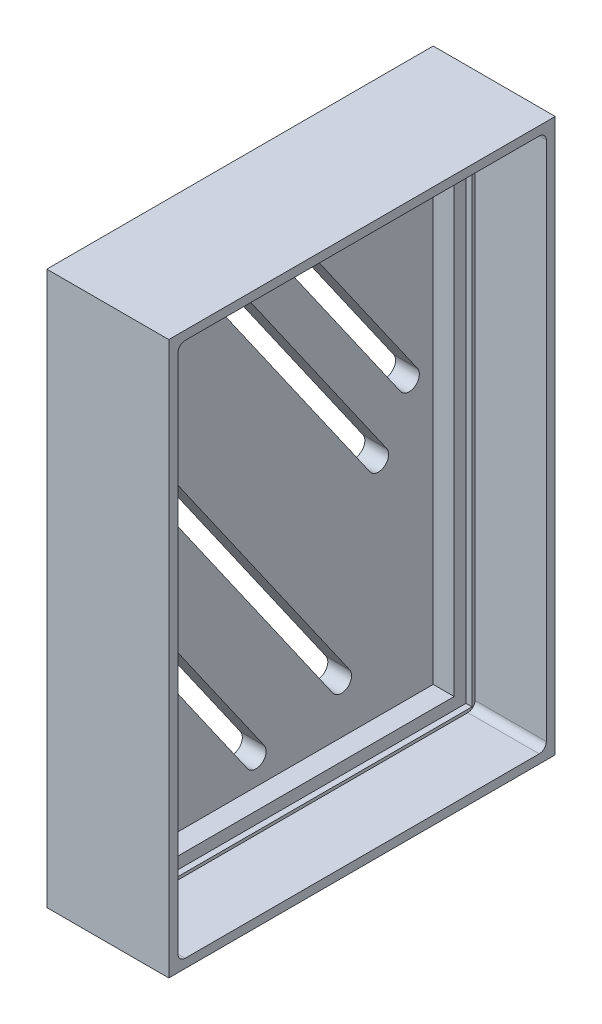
ISO-10303-21;
HEADER;
FILE_DESCRIPTION(('STEP AP214'),'2;1');
FILE_NAME('part.step','',(''),(''),'','','');
FILE_SCHEMA(('AUTOMOTIVE_DESIGN { 1 0 10303 214 1 1 1 1 }'));
ENDSEC;
DATA;
#1=APPLICATION_CONTEXT('core data for automotive mechanical design processes');
#2=APPLICATION_PROTOCOL_DEFINITION('international standard','automotive_design',2000,#1);
#3=PRODUCT_CONTEXT('',#1,'mechanical');
#4=PRODUCT('Part','Part','',(#3));
#5=PRODUCT_RELATED_PRODUCT_CATEGORY('part','',(#4));
#6=PRODUCT_DEFINITION_FORMATION('','',#4);
#7=PRODUCT_DEFINITION_CONTEXT('part definition',#1,'design');
#8=PRODUCT_DEFINITION('design','',#6,#7);
#9=PRODUCT_DEFINITION_SHAPE('','',#8);
#10=(LENGTH_UNIT() NAMED_UNIT(*) SI_UNIT(.MILLI.,.METRE.));
#11=(NAMED_UNIT(*) PLANE_ANGLE_UNIT() SI_UNIT($,.RADIAN.));
#12=(NAMED_UNIT(*) SI_UNIT($,.STERADIAN.) SOLID_ANGLE_UNIT());
#13=UNCERTAINTY_MEASURE_WITH_UNIT(LENGTH_MEASURE(1.E-05),#10,'distance_accuracy_value','');
#14=(GEOMETRIC_REPRESENTATION_CONTEXT(3) GLOBAL_UNCERTAINTY_ASSIGNED_CONTEXT((#13)) GLOBAL_UNIT_ASSIGNED_CONTEXT((#10,
#11,#12)) REPRESENTATION_CONTEXT('',''));
#15=CARTESIAN_POINT('',(0.,0.,0.));
#16=DIRECTION('',(0.,0.,1.));
#17=DIRECTION('',(1.,0.,0.));
#18=AXIS2_PLACEMENT_3D('',#15,#16,#17);
#19=CARTESIAN_POINT('',(3.76119657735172,-20.1522556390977,-15.9031954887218));
#20=DIRECTION('',(0.,-1.,0.));
#21=DIRECTION('',(0.,0.,-1.));
#22=AXIS2_PLACEMENT_3D('',#19,#20,#21);
#23=PLANE('',#22);
#24=DIRECTION('',(1.,0.,0.));
#25=VECTOR('',#24,1.);
#26=CARTESIAN_POINT('',(3.76119657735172,-20.1522556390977,13.5725599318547));
#27=LINE('',#26,#25);
#28=CARTESIAN_POINT('',(3.76119657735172,-20.1522556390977,13.5725599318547));
#29=VERTEX_POINT('',#28);
#30=CARTESIAN_POINT('',(4.26119657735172,-20.1522556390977,13.5725599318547));
#31=VERTEX_POINT('',#30);
#32=EDGE_CURVE('E307',#29,#31,#27,.T.);
#33=ORIENTED_EDGE('',*,*,#32,.T.);
#34=DIRECTION('',(0.,0.,1.));
#35=VECTOR('',#34,1.);
#36=CARTESIAN_POINT('',(4.26119657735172,-20.1522556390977,-16.9031954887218));
#37=LINE('',#36,#35);
#38=CARTESIAN_POINT('',(4.26119657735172,-20.1522556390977,-16.9031954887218));
#39=VERTEX_POINT('',#38);
#40=EDGE_CURVE('E288',#39,#31,#37,.T.);
#41=ORIENTED_EDGE('',*,*,#40,.F.);
#42=DIRECTION('',(1.,0.,0.));
#43=VECTOR('',#42,1.);
#44=CARTESIAN_POINT('',(3.76119657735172,-20.1522556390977,-16.9031954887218));
#45=LINE('',#44,#43);
#46=CARTESIAN_POINT('',(3.76119657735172,-20.1522556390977,-16.9031954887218));
#47=VERTEX_POINT('',#46);
#48=EDGE_CURVE('E317',#47,#39,#45,.T.);
#49=ORIENTED_EDGE('',*,*,#48,.F.);
#50=DIRECTION('',(0.,0.,-1.));
#51=VECTOR('',#50,1.);
#52=CARTESIAN_POINT('',(3.76119657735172,-20.1522556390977,-15.9031954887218));
#53=LINE('',#52,#51);
#54=EDGE_CURVE('E315',#29,#47,#53,.T.);
#55=ORIENTED_EDGE('',*,*,#54,.F.);
#56=EDGE_LOOP('',(#33,#41,#49,#55));
#57=FACE_BOUND('',#56,.T.);
#58=ADVANCED_FACE('F44',(#57),#23,.F.);
#59=CARTESIAN_POINT('',(3.76119657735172,24.3477443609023,13.5725599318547));
#60=DIRECTION('',(0.,1.,0.));
#61=DIRECTION('',(0.,0.,1.));
#62=AXIS2_PLACEMENT_3D('',#59,#60,#61);
#63=PLANE('',#62);
#64=DIRECTION('',(0.,0.,-1.));
#65=VECTOR('',#64,1.);
#66=CARTESIAN_POINT('',(4.26119657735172,24.3477443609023,13.5725599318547));
#67=LINE('',#66,#65);
#68=CARTESIAN_POINT('',(4.26119657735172,24.3477443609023,13.5725599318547));
#69=VERTEX_POINT('',#68);
#70=CARTESIAN_POINT('',(4.26119657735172,24.3477443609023,-16.9031954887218));
#71=VERTEX_POINT('',#70);
#72=EDGE_CURVE('E677',#69,#71,#67,.T.);
#73=ORIENTED_EDGE('',*,*,#72,.F.);
#74=DIRECTION('',(1.,0.,0.));
#75=VECTOR('',#74,1.);
#76=CARTESIAN_POINT('',(3.76119657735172,24.3477443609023,13.5725599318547));
#77=LINE('',#76,#75);
#78=CARTESIAN_POINT('',(3.76119657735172,24.3477443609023,13.5725599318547));
#79=VERTEX_POINT('',#78);
#80=EDGE_CURVE('E309',#79,#69,#77,.T.);
#81=ORIENTED_EDGE('',*,*,#80,.F.);
#82=DIRECTION('',(0.,0.,1.));
#83=VECTOR('',#82,1.);
#84=CARTESIAN_POINT('',(3.76119657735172,24.3477443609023,13.5725599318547));
#85=LINE('',#84,#83);
#86=CARTESIAN_POINT('',(3.76119657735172,24.3477443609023,-16.9031954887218));
#87=VERTEX_POINT('',#86);
#88=EDGE_CURVE('E642',#87,#79,#85,.T.);
#89=ORIENTED_EDGE('',*,*,#88,.F.);
#90=DIRECTION('',(1.,0.,0.));
#91=VECTOR('',#90,1.);
#92=CARTESIAN_POINT('',(3.76119657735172,24.3477443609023,-16.9031954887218));
#93=LINE('',#92,#91);
#94=EDGE_CURVE('E321',#87,#71,#93,.T.);
#95=ORIENTED_EDGE('',*,*,#94,.T.);
#96=EDGE_LOOP('',(#73,#81,#89,#95));
#97=FACE_BOUND('',#96,.T.);
#98=ADVANCED_FACE('F735',(#97),#63,.F.);
#99=CARTESIAN_POINT('',(3.76119657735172,24.3477443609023,-16.9031954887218));
#100=DIRECTION('',(0.,0.,-1.));
#101=DIRECTION('',(-1.,0.,0.));
#102=AXIS2_PLACEMENT_3D('',#99,#100,#101);
#103=PLANE('',#102);
#104=DIRECTION('',(0.,-1.,0.));
#105=VECTOR('',#104,1.);
#106=CARTESIAN_POINT('',(4.26119657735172,24.3477443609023,-16.9031954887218));
#107=LINE('',#106,#105);
#108=EDGE_CURVE('E295',#71,#39,#107,.T.);
#109=ORIENTED_EDGE('',*,*,#108,.F.);
#110=ORIENTED_EDGE('',*,*,#94,.F.);
#111=DIRECTION('',(0.,1.,0.));
#112=VECTOR('',#111,1.);
#113=CARTESIAN_POINT('',(3.76119657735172,24.3477443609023,-16.9031954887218));
#114=LINE('',#113,#112);
#115=EDGE_CURVE('E323',#47,#87,#114,.T.);
#116=ORIENTED_EDGE('',*,*,#115,.F.);
#117=ORIENTED_EDGE('',*,*,#48,.T.);
#118=EDGE_LOOP('',(#109,#110,#116,#117));
#119=FACE_BOUND('',#118,.T.);
#120=ADVANCED_FACE('F740',(#119),#103,.F.);
#121=CARTESIAN_POINT('',(3.76119657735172,24.3477443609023,13.5725599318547));
#122=DIRECTION('',(0.,0.,1.));
#123=DIRECTION('',(0.,-1.,0.));
#124=AXIS2_PLACEMENT_3D('',#121,#122,#123);
#125=PLANE('',#124);
#126=DIRECTION('',(0.,1.,0.));
#127=VECTOR('',#126,1.);
#128=CARTESIAN_POINT('',(4.26119657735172,24.3477443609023,13.5725599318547));
#129=LINE('',#128,#127);
#130=EDGE_CURVE('E292',#31,#69,#129,.T.);
#131=ORIENTED_EDGE('',*,*,#130,.F.);
#132=ORIENTED_EDGE('',*,*,#32,.F.);
#133=DIRECTION('',(0.,-1.,0.));
#134=VECTOR('',#133,1.);
#135=CARTESIAN_POINT('',(3.76119657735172,24.3477443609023,13.5725599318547));
#136=LINE('',#135,#134);
#137=EDGE_CURVE('E639',#79,#29,#136,.T.);
#138=ORIENTED_EDGE('',*,*,#137,.F.);
#139=ORIENTED_EDGE('',*,*,#80,.T.);
#140=EDGE_LOOP('',(#131,#132,#138,#139));
#141=FACE_BOUND('',#140,.T.);
#142=ADVANCED_FACE('F305',(#141),#125,.F.);
#143=CARTESIAN_POINT('',(0.,-19.1522556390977,12.5968045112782));
#144=DIRECTION('',(1.,0.,0.));
#145=DIRECTION('',(0.,0.,-1.));
#146=AXIS2_PLACEMENT_3D('',#143,#144,#145);
#147=CYLINDRICAL_SURFACE('',#146,1.5);
#148=DIRECTION('',(1.,0.,0.));
#149=VECTOR('',#148,1.);
#150=CARTESIAN_POINT('',(0.,-17.6522556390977,12.5968045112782));
#151=LINE('',#150,#149);
#152=CARTESIAN_POINT('',(2.,-17.6522556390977,12.5968045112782));
#153=VERTEX_POINT('',#152);
#154=CARTESIAN_POINT('',(3.76119657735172,-17.6522556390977,12.5968045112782));
#155=VERTEX_POINT('',#154);
#156=EDGE_CURVE('E330',#153,#155,#151,.T.);
#157=ORIENTED_EDGE('',*,*,#156,.T.);
#158=CARTESIAN_POINT('',(3.76119657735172,-19.1522556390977,12.5968045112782));
#159=DIRECTION('',(1.,0.,0.));
#160=DIRECTION('',(0.,0.,-1.));
#161=AXIS2_PLACEMENT_3D('',#158,#159,#160);
#162=CIRCLE('',#161,1.5);
#163=CARTESIAN_POINT('',(3.76119657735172,-19.1522556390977,11.0968045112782));
#164=VERTEX_POINT('',#163);
#165=EDGE_CURVE('E650',#164,#155,#162,.T.);
#166=ORIENTED_EDGE('',*,*,#165,.F.);
#167=DIRECTION('',(1.,0.,0.));
#168=VECTOR('',#167,1.);
#169=CARTESIAN_POINT('',(0.,-19.1522556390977,11.0968045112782));
#170=LINE('',#169,#168);
#171=CARTESIAN_POINT('',(2.,-19.1522556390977,11.0968045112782));
#172=VERTEX_POINT('',#171);
#173=EDGE_CURVE('E327',#164,#172,#170,.F.);
#174=ORIENTED_EDGE('',*,*,#173,.T.);
#175=CARTESIAN_POINT('',(2.,-19.1522556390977,12.5968045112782));
#176=DIRECTION('',(1.,0.,0.));
#177=DIRECTION('',(0.,0.,-1.));
#178=AXIS2_PLACEMENT_3D('',#175,#176,#177);
#179=CIRCLE('',#178,1.5);
#180=EDGE_CURVE('E312',#172,#153,#179,.T.);
#181=ORIENTED_EDGE('',*,*,#180,.T.);
#182=EDGE_LOOP('',(#157,#166,#174,#181));
#183=FACE_BOUND('',#182,.T.);
#184=ADVANCED_FACE('F745',(#183),#147,.T.);
#185=CARTESIAN_POINT('',(10.2611965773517,-19.1522556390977,14.5968045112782));
#186=DIRECTION('',(0.,1.,0.));
#187=DIRECTION('',(0.,0.,1.));
#188=AXIS2_PLACEMENT_3D('',#185,#186,#187);
#189=PLANE('',#188);
#190=ORIENTED_EDGE('',*,*,#173,.F.);
#191=DIRECTION('',(0.,0.,1.));
#192=VECTOR('',#191,1.);
#193=CARTESIAN_POINT('',(3.76119657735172,-19.1522556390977,-15.9031954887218));
#194=LINE('',#193,#192);
#195=CARTESIAN_POINT('',(3.76119657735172,-19.1522556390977,-15.9031954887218));
#196=VERTEX_POINT('',#195);
#197=EDGE_CURVE('E646',#196,#164,#194,.T.);
#198=ORIENTED_EDGE('',*,*,#197,.F.);
#199=DIRECTION('',(-1.,0.,0.));
#200=VECTOR('',#199,1.);
#201=CARTESIAN_POINT('',(10.2611965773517,-19.1522556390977,-15.9031954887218));
#202=LINE('',#201,#200);
#203=CARTESIAN_POINT('',(2.,-19.1522556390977,-15.9031954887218));
#204=VERTEX_POINT('',#203);
#205=EDGE_CURVE('E460',#196,#204,#202,.T.);
#206=ORIENTED_EDGE('',*,*,#205,.T.);
#207=DIRECTION('',(0.,0.,-1.));
#208=VECTOR('',#207,1.);
#209=CARTESIAN_POINT('',(2.,-19.1522556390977,14.5968045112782));
#210=LINE('',#209,#208);
#211=EDGE_CURVE('E456',#172,#204,#210,.T.);
#212=ORIENTED_EDGE('',*,*,#211,.F.);
#213=EDGE_LOOP('',(#190,#198,#206,#212));
#214=FACE_BOUND('',#213,.T.);
#215=ADVANCED_FACE('F749',(#214),#189,.T.);
#216=CARTESIAN_POINT('',(10.2611965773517,25.3477443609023,14.5968045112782));
#217=DIRECTION('',(0.,0.,-1.));
#218=DIRECTION('',(0.,1.,0.));
#219=AXIS2_PLACEMENT_3D('',#216,#217,#218);
#220=PLANE('',#219);
#221=DIRECTION('',(0.,-1.,0.));
#222=VECTOR('',#221,1.);
#223=CARTESIAN_POINT('',(0.,25.3477443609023,14.5968045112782));
#224=LINE('',#223,#222);
#225=CARTESIAN_POINT('',(0.,25.3477443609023,14.5968045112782));
#226=VERTEX_POINT('',#225);
#227=CARTESIAN_POINT('',(0.,-21.1522556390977,14.5968045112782));
#228=VERTEX_POINT('',#227);
#229=EDGE_CURVE('E468',#226,#228,#224,.T.);
#230=ORIENTED_EDGE('',*,*,#229,.T.);
#231=DIRECTION('',(-1.,0.,0.));
#232=VECTOR('',#231,1.);
#233=CARTESIAN_POINT('',(10.2611965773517,-21.1522556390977,14.5968045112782));
#234=LINE('',#233,#232);
#235=CARTESIAN_POINT('',(10.2611965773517,-21.1522556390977,14.5968045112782));
#236=VERTEX_POINT('',#235);
#237=EDGE_CURVE('E511',#236,#228,#234,.T.);
#238=ORIENTED_EDGE('',*,*,#237,.F.);
#239=DIRECTION('',(0.,-1.,0.));
#240=VECTOR('',#239,1.);
#241=CARTESIAN_POINT('',(10.2611965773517,25.3477443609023,14.5968045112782));
#242=LINE('',#241,#240);
#243=CARTESIAN_POINT('',(10.2611965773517,25.3477443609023,14.5968045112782));
#244=VERTEX_POINT('',#243);
#245=EDGE_CURVE('E474',#244,#236,#242,.T.);
#246=ORIENTED_EDGE('',*,*,#245,.F.);
#247=DIRECTION('',(-1.,0.,0.));
#248=VECTOR('',#247,1.);
#249=CARTESIAN_POINT('',(10.2611965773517,25.3477443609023,14.5968045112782));
#250=LINE('',#249,#248);
#251=EDGE_CURVE('E488',#244,#226,#250,.T.);
#252=ORIENTED_EDGE('',*,*,#251,.T.);
#253=EDGE_LOOP('',(#230,#238,#246,#252));
#254=FACE_BOUND('',#253,.T.);
#255=ADVANCED_FACE('F827',(#254),#220,.F.);
#256=CARTESIAN_POINT('',(10.2611965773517,-21.1522556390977,14.5968045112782));
#257=DIRECTION('',(0.,1.,0.));
#258=DIRECTION('',(0.,0.,1.));
#259=AXIS2_PLACEMENT_3D('',#256,#257,#258);
#260=PLANE('',#259);
#261=DIRECTION('',(0.,0.,-1.));
#262=VECTOR('',#261,1.);
#263=CARTESIAN_POINT('',(0.,-21.1522556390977,14.5968045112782));
#264=LINE('',#263,#262);
#265=CARTESIAN_POINT('',(0.,-21.1522556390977,-17.9031954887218));
#266=VERTEX_POINT('',#265);
#267=EDGE_CURVE('E492',#228,#266,#264,.T.);
#268=ORIENTED_EDGE('',*,*,#267,.T.);
#269=DIRECTION('',(-1.,0.,0.));
#270=VECTOR('',#269,1.);
#271=CARTESIAN_POINT('',(10.2611965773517,-21.1522556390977,-17.9031954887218));
#272=LINE('',#271,#270);
#273=CARTESIAN_POINT('',(10.2611965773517,-21.1522556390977,-17.9031954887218));
#274=VERTEX_POINT('',#273);
#275=EDGE_CURVE('E507',#274,#266,#272,.T.);
#276=ORIENTED_EDGE('',*,*,#275,.F.);
#277=DIRECTION('',(0.,0.,-1.));
#278=VECTOR('',#277,1.);
#279=CARTESIAN_POINT('',(10.2611965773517,-21.1522556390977,14.5968045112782));
#280=LINE('',#279,#278);
#281=EDGE_CURVE('E478',#236,#274,#280,.T.);
#282=ORIENTED_EDGE('',*,*,#281,.F.);
#283=ORIENTED_EDGE('',*,*,#237,.T.);
#284=EDGE_LOOP('',(#268,#276,#282,#283));
#285=FACE_BOUND('',#284,.T.);
#286=ADVANCED_FACE('F851',(#285),#260,.F.);
#287=CARTESIAN_POINT('',(10.2611965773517,25.3477443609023,-17.9031954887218));
#288=DIRECTION('',(0.,0.,1.));
#289=DIRECTION('',(0.,-1.,0.));
#290=AXIS2_PLACEMENT_3D('',#287,#288,#289);
#291=PLANE('',#290);
#292=DIRECTION('',(0.,1.,0.));
#293=VECTOR('',#292,1.);
#294=CARTESIAN_POINT('',(0.,25.3477443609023,-17.9031954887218));
#295=LINE('',#294,#293);
#296=CARTESIAN_POINT('',(0.,25.3477443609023,-17.9031954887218));
#297=VERTEX_POINT('',#296);
#298=EDGE_CURVE('E495',#266,#297,#295,.T.);
#299=ORIENTED_EDGE('',*,*,#298,.T.);
#300=DIRECTION('',(-1.,0.,0.));
#301=VECTOR('',#300,1.);
#302=CARTESIAN_POINT('',(10.2611965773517,25.3477443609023,-17.9031954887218));
#303=LINE('',#302,#301);
#304=CARTESIAN_POINT('',(10.2611965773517,25.3477443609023,-17.9031954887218));
#305=VERTEX_POINT('',#304);
#306=EDGE_CURVE('E503',#305,#297,#303,.T.);
#307=ORIENTED_EDGE('',*,*,#306,.F.);
#308=DIRECTION('',(0.,1.,0.));
#309=VECTOR('',#308,1.);
#310=CARTESIAN_POINT('',(10.2611965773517,25.3477443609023,-17.9031954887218));
#311=LINE('',#310,#309);
#312=EDGE_CURVE('E482',#274,#305,#311,.T.);
#313=ORIENTED_EDGE('',*,*,#312,.F.);
#314=ORIENTED_EDGE('',*,*,#275,.T.);
#315=EDGE_LOOP('',(#299,#307,#313,#314));
#316=FACE_BOUND('',#315,.T.);
#317=ADVANCED_FACE('F847',(#316),#291,.F.);
#318=CARTESIAN_POINT('',(10.2611965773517,25.3477443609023,14.5968045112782));
#319=DIRECTION('',(0.,-1.,0.));
#320=DIRECTION('',(0.,0.,-1.));
#321=AXIS2_PLACEMENT_3D('',#318,#319,#320);
#322=PLANE('',#321);
#323=DIRECTION('',(0.,0.,1.));
#324=VECTOR('',#323,1.);
#325=CARTESIAN_POINT('',(0.,25.3477443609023,14.5968045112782));
#326=LINE('',#325,#324);
#327=EDGE_CURVE('E479',#297,#226,#326,.T.);
#328=ORIENTED_EDGE('',*,*,#327,.T.);
#329=ORIENTED_EDGE('',*,*,#251,.F.);
#330=DIRECTION('',(0.,0.,1.));
#331=VECTOR('',#330,1.);
#332=CARTESIAN_POINT('',(10.2611965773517,25.3477443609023,14.5968045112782));
#333=LINE('',#332,#331);
#334=EDGE_CURVE('E485',#305,#244,#333,.T.);
#335=ORIENTED_EDGE('',*,*,#334,.F.);
#336=ORIENTED_EDGE('',*,*,#306,.T.);
#337=EDGE_LOOP('',(#328,#329,#335,#336));
#338=FACE_BOUND('',#337,.T.);
#339=ADVANCED_FACE('F841',(#338),#322,.F.);
#340=CARTESIAN_POINT('',(10.2611965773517,0.,0.));
#341=DIRECTION('',(1.,0.,0.));
#342=DIRECTION('',(0.,0.,-1.));
#343=AXIS2_PLACEMENT_3D('',#340,#341,#342);
#344=PLANE('',#343);
#345=DIRECTION('',(0.,1.,0.));
#346=VECTOR('',#345,1.);
#347=CARTESIAN_POINT('',(10.2611965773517,24.3046663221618,-17.1531954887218));
#348=LINE('',#347,#346);
#349=CARTESIAN_POINT('',(10.2611965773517,-19.8022556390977,-17.1531954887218));
#350=VERTEX_POINT('',#349);
#351=CARTESIAN_POINT('',(10.2611965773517,23.9977443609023,-17.1531954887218));
#352=VERTEX_POINT('',#351);
#353=EDGE_CURVE('E656',#350,#352,#348,.T.);
#354=ORIENTED_EDGE('',*,*,#353,.F.);
#355=CARTESIAN_POINT('',(10.2611965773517,-19.8022556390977,-16.5531954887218));
#356=DIRECTION('',(1.,0.,0.));
#357=DIRECTION('',(0.,0.,-1.));
#358=AXIS2_PLACEMENT_3D('',#355,#356,#357);
#359=CIRCLE('',#358,0.6);
#360=CARTESIAN_POINT('',(10.2611965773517,-20.4022556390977,-16.5531954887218));
#361=VERTEX_POINT('',#360);
#362=EDGE_CURVE('E53',#350,#361,#359,.F.);
#363=ORIENTED_EDGE('',*,*,#362,.T.);
#364=DIRECTION('',(0.,0.,-1.));
#365=VECTOR('',#364,1.);
#366=CARTESIAN_POINT('',(10.2611965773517,-20.4022556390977,13.8225599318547));
#367=LINE('',#366,#365);
#368=CARTESIAN_POINT('',(10.2611965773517,-20.4022556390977,13.2225599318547));
#369=VERTEX_POINT('',#368);
#370=EDGE_CURVE('E661',#369,#361,#367,.T.);
#371=ORIENTED_EDGE('',*,*,#370,.F.);
#372=CARTESIAN_POINT('',(10.2611965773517,-19.8022556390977,13.2225599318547));
#373=DIRECTION('',(1.,0.,0.));
#374=DIRECTION('',(0.,0.,-1.));
#375=AXIS2_PLACEMENT_3D('',#372,#373,#374);
#376=CIRCLE('',#375,0.6);
#377=CARTESIAN_POINT('',(10.2611965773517,-19.8022556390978,13.8225599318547));
#378=VERTEX_POINT('',#377);
#379=EDGE_CURVE('E11',#369,#378,#376,.F.);
#380=ORIENTED_EDGE('',*,*,#379,.T.);
#381=DIRECTION('',(0.,-1.,0.));
#382=VECTOR('',#381,1.);
#383=CARTESIAN_POINT('',(10.2611965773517,19.2307915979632,13.8225599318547));
#384=LINE('',#383,#382);
#385=CARTESIAN_POINT('',(10.2611965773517,23.9977443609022,13.8225599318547));
#386=VERTEX_POINT('',#385);
#387=EDGE_CURVE('E664',#386,#378,#384,.T.);
#388=ORIENTED_EDGE('',*,*,#387,.F.);
#389=CARTESIAN_POINT('',(10.2611965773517,23.9977443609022,13.2225599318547));
#390=DIRECTION('',(1.,0.,0.));
#391=DIRECTION('',(0.,0.,-1.));
#392=AXIS2_PLACEMENT_3D('',#389,#390,#391);
#393=CIRCLE('',#392,0.6);
#394=CARTESIAN_POINT('',(10.2611965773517,24.5977443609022,13.2225599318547));
#395=VERTEX_POINT('',#394);
#396=EDGE_CURVE('E612',#386,#395,#393,.F.);
#397=ORIENTED_EDGE('',*,*,#396,.T.);
#398=DIRECTION('',(0.,0.,1.));
#399=VECTOR('',#398,1.);
#400=CARTESIAN_POINT('',(10.2611965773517,24.5977443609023,-15.4267434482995));
#401=LINE('',#400,#399);
#402=CARTESIAN_POINT('',(10.2611965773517,24.5977443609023,-16.5531954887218));
#403=VERTEX_POINT('',#402);
#404=EDGE_CURVE('E668',#403,#395,#401,.T.);
#405=ORIENTED_EDGE('',*,*,#404,.F.);
#406=CARTESIAN_POINT('',(10.2611965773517,23.9977443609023,-16.5531954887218));
#407=DIRECTION('',(1.,0.,0.));
#408=DIRECTION('',(0.,0.,-1.));
#409=AXIS2_PLACEMENT_3D('',#406,#407,#408);
#410=CIRCLE('',#409,0.6);
#411=EDGE_CURVE('E615',#403,#352,#410,.F.);
#412=ORIENTED_EDGE('',*,*,#411,.T.);
#413=EDGE_LOOP('',(#354,#363,#371,#380,#388,#397,#405,#412));
#414=FACE_BOUND('',#413,.T.);
#415=ORIENTED_EDGE('',*,*,#245,.T.);
#416=ORIENTED_EDGE('',*,*,#281,.T.);
#417=ORIENTED_EDGE('',*,*,#312,.T.);
#418=ORIENTED_EDGE('',*,*,#334,.T.);
#419=EDGE_LOOP('',(#415,#416,#417,#418));
#420=FACE_BOUND('',#419,.T.);
#421=ADVANCED_FACE('F704',(#414,#420),#344,.T.);
#422=CARTESIAN_POINT('',(0.,0.,0.));
#423=DIRECTION('',(1.,0.,0.));
#424=DIRECTION('',(0.,0.,-1.));
#425=AXIS2_PLACEMENT_3D('',#422,#423,#424);
#426=PLANE('',#425);
#427=DIRECTION('',(0.,-0.819645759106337,-0.572870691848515));
#428=VECTOR('',#427,1.);
#429=CARTESIAN_POINT('',(0.,20.4717613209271,2.32335093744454));
#430=LINE('',#429,#428);
#431=CARTESIAN_POINT('',(0.,20.4717613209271,2.32335093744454));
#432=VERTEX_POINT('',#431);
#433=CARTESIAN_POINT('',(0.,-0.0193826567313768,-11.9984163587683));
#434=VERTEX_POINT('',#433);
#435=EDGE_CURVE('E390',#432,#434,#430,.T.);
#436=ORIENTED_EDGE('',*,*,#435,.F.);
#437=CARTESIAN_POINT('',(0.,19.9776758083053,3.03027328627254));
#438=DIRECTION('',(-1.,0.,0.));
#439=DIRECTION('',(0.,0.,-1.));
#440=AXIS2_PLACEMENT_3D('',#437,#438,#439);
#441=CIRCLE('',#440,0.862473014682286);
#442=CARTESIAN_POINT('',(0.,19.4835902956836,3.73719563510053));
#443=VERTEX_POINT('',#442);
#444=EDGE_CURVE('E394',#443,#432,#441,.T.);
#445=ORIENTED_EDGE('',*,*,#444,.F.);
#446=DIRECTION('',(0.,0.819645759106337,0.572870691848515));
#447=VECTOR('',#446,1.);
#448=CARTESIAN_POINT('',(0.,19.4835902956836,3.73719563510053));
#449=LINE('',#448,#447);
#450=CARTESIAN_POINT('',(0.,-1.00755368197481,-10.5845716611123));
#451=VERTEX_POINT('',#450);
#452=EDGE_CURVE('E374',#451,#443,#449,.T.);
#453=ORIENTED_EDGE('',*,*,#452,.F.);
#454=CARTESIAN_POINT('',(0.,-0.513468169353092,-11.2914940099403));
#455=DIRECTION('',(-1.,0.,0.));
#456=DIRECTION('',(0.,0.,1.));
#457=AXIS2_PLACEMENT_3D('',#454,#455,#456);
#458=CIRCLE('',#457,0.862473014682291);
#459=EDGE_CURVE('E386',#434,#451,#458,.T.);
#460=ORIENTED_EDGE('',*,*,#459,.F.);
#461=EDGE_LOOP('',(#436,#445,#453,#460));
#462=FACE_BOUND('',#461,.T.);
#463=DIRECTION('',(0.,-0.819645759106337,-0.572870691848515));
#464=VECTOR('',#463,1.);
#465=CARTESIAN_POINT('',(0.,-0.0989813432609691,9.76229267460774));
#466=LINE('',#465,#464);
#467=CARTESIAN_POINT('',(0.,-0.0989813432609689,9.76229267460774));
#468=VERTEX_POINT('',#467);
#469=CARTESIAN_POINT('',(0.,-16.4918965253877,-1.69512116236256));
#470=VERTEX_POINT('',#469);
#471=EDGE_CURVE('E418',#468,#470,#466,.T.);
#472=ORIENTED_EDGE('',*,*,#471,.F.);
#473=CARTESIAN_POINT('',(0.,-0.591650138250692,10.4671880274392));
#474=DIRECTION('',(-1.,0.,0.));
#475=DIRECTION('',(0.,0.,-1.));
#476=AXIS2_PLACEMENT_3D('',#473,#474,#475);
#477=CIRCLE('',#476,0.860000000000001);
#478=CARTESIAN_POINT('',(0.,-1.08431893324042,11.1720833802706));
#479=VERTEX_POINT('',#478);
#480=EDGE_CURVE('E422',#479,#468,#477,.T.);
#481=ORIENTED_EDGE('',*,*,#480,.F.);
#482=DIRECTION('',(0.,0.819645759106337,0.572870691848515));
#483=VECTOR('',#482,1.);
#484=CARTESIAN_POINT('',(0.,-1.08431893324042,11.1720833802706));
#485=LINE('',#484,#483);
#486=CARTESIAN_POINT('',(0.,-17.4767775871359,-0.28501137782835));
#487=VERTEX_POINT('',#486);
#488=EDGE_CURVE('E402',#487,#479,#485,.T.);
#489=ORIENTED_EDGE('',*,*,#488,.F.);
#490=CARTESIAN_POINT('',(0.,-16.9843370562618,-0.990066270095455));
#491=DIRECTION('',(-1.,0.,0.));
#492=DIRECTION('',(0.,0.,1.));
#493=AXIS2_PLACEMENT_3D('',#490,#491,#492);
#494=CIRCLE('',#493,0.860000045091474);
#495=EDGE_CURVE('E414',#470,#487,#494,.T.);
#496=ORIENTED_EDGE('',*,*,#495,.F.);
#497=EDGE_LOOP('',(#472,#481,#489,#496));
#498=FACE_BOUND('',#497,.T.);
#499=DIRECTION('',(0.,-0.819645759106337,-0.572870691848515));
#500=VECTOR('',#499,1.);
#501=CARTESIAN_POINT('',(0.,20.917445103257,-3.12534741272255));
#502=LINE('',#501,#500);
#503=CARTESIAN_POINT('',(0.,20.917445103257,-3.12534741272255));
#504=VERTEX_POINT('',#503);
#505=CARTESIAN_POINT('',(0.,4.52635603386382,-14.5814849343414));
#506=VERTEX_POINT('',#505);
#507=EDGE_CURVE('E362',#504,#506,#502,.T.);
#508=ORIENTED_EDGE('',*,*,#507,.F.);
#509=CARTESIAN_POINT('',(0.,20.4247768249,-2.42045279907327));
#510=DIRECTION('',(-1.,0.,0.));
#511=DIRECTION('',(0.,0.,-1.));
#512=AXIS2_PLACEMENT_3D('',#509,#510,#511);
#513=CIRCLE('',#512,0.859999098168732);
#514=CARTESIAN_POINT('',(0.,19.932108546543,-1.715558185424));
#515=VERTEX_POINT('',#514);
#516=EDGE_CURVE('E366',#515,#504,#513,.T.);
#517=ORIENTED_EDGE('',*,*,#516,.F.);
#518=DIRECTION('',(0.,0.819645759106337,0.572870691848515));
#519=VECTOR('',#518,1.);
#520=CARTESIAN_POINT('',(0.,19.932108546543,-1.715558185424));
#521=LINE('',#520,#519);
#522=CARTESIAN_POINT('',(0.,3.5419325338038,-13.1710575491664));
#523=VERTEX_POINT('',#522);
#524=EDGE_CURVE('E346',#523,#515,#521,.T.);
#525=ORIENTED_EDGE('',*,*,#524,.F.);
#526=CARTESIAN_POINT('',(0.,4.03414428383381,-13.8762712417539));
#527=DIRECTION('',(-1.,0.,0.));
#528=DIRECTION('',(0.,0.,1.));
#529=AXIS2_PLACEMENT_3D('',#526,#527,#528);
#530=CIRCLE('',#529,0.859999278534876);
#531=EDGE_CURVE('E358',#506,#523,#530,.T.);
#532=ORIENTED_EDGE('',*,*,#531,.F.);
#533=EDGE_LOOP('',(#508,#517,#525,#532));
#534=FACE_BOUND('',#533,.T.);
#535=DIRECTION('',(0.,-0.819645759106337,-0.572870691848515));
#536=VECTOR('',#535,1.);
#537=CARTESIAN_POINT('',(0.,5.91022530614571,5.4386564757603));
#538=LINE('',#537,#536);
#539=CARTESIAN_POINT('',(0.,5.91022530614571,5.4386564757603));
#540=VERTEX_POINT('',#539);
#541=CARTESIAN_POINT('',(0.,-14.5809186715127,-8.88311082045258));
#542=VERTEX_POINT('',#541);
#543=EDGE_CURVE('E428',#540,#542,#538,.T.);
#544=ORIENTED_EDGE('',*,*,#543,.F.);
#545=CARTESIAN_POINT('',(0.,5.416139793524,6.14557882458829));
#546=DIRECTION('',(-1.,0.,0.));
#547=DIRECTION('',(0.,0.,-1.));
#548=AXIS2_PLACEMENT_3D('',#545,#546,#547);
#549=CIRCLE('',#548,0.862473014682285);
#550=CARTESIAN_POINT('',(0.,4.92205428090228,6.85250117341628));
#551=VERTEX_POINT('',#550);
#552=EDGE_CURVE('E425',#551,#540,#549,.T.);
#553=ORIENTED_EDGE('',*,*,#552,.F.);
#554=DIRECTION('',(0.,0.819645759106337,0.572870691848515));
#555=VECTOR('',#554,1.);
#556=CARTESIAN_POINT('',(0.,4.92205428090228,6.85250117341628));
#557=LINE('',#556,#555);
#558=CARTESIAN_POINT('',(0.,-15.5690896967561,-7.46926612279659));
#559=VERTEX_POINT('',#558);
#560=EDGE_CURVE('E436',#559,#551,#557,.T.);
#561=ORIENTED_EDGE('',*,*,#560,.F.);
#562=CARTESIAN_POINT('',(0.,-15.0750041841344,-8.17618847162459));
#563=DIRECTION('',(-1.,0.,0.));
#564=DIRECTION('',(0.,0.,1.));
#565=AXIS2_PLACEMENT_3D('',#562,#563,#564);
#566=CIRCLE('',#565,0.862473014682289);
#567=EDGE_CURVE('E432',#542,#559,#566,.T.);
#568=ORIENTED_EDGE('',*,*,#567,.F.);
#569=EDGE_LOOP('',(#544,#553,#561,#568));
#570=FACE_BOUND('',#569,.T.);
#571=ORIENTED_EDGE('',*,*,#229,.F.);
#572=ORIENTED_EDGE('',*,*,#327,.F.);
#573=ORIENTED_EDGE('',*,*,#298,.F.);
#574=ORIENTED_EDGE('',*,*,#267,.F.);
#575=EDGE_LOOP('',(#571,#572,#573,#574));
#576=FACE_BOUND('',#575,.T.);
#577=ADVANCED_FACE('F823',(#462,#498,#534,#570,#576),#426,.F.);
#578=CARTESIAN_POINT('',(10.2611965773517,25.3477443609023,12.5968045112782));
#579=DIRECTION('',(0.,0.,-1.));
#580=DIRECTION('',(0.,1.,0.));
#581=AXIS2_PLACEMENT_3D('',#578,#579,#580);
#582=PLANE('',#581);
#583=DIRECTION('',(0.,1.,0.));
#584=VECTOR('',#583,1.);
#585=CARTESIAN_POINT('',(3.76119657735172,-20.1522556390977,12.5968045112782));
#586=LINE('',#585,#584);
#587=CARTESIAN_POINT('',(3.76119657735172,23.3477443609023,12.5968045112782));
#588=VERTEX_POINT('',#587);
#589=EDGE_CURVE('E636',#155,#588,#586,.T.);
#590=ORIENTED_EDGE('',*,*,#589,.F.);
#591=ORIENTED_EDGE('',*,*,#156,.F.);
#592=DIRECTION('',(0.,-1.,0.));
#593=VECTOR('',#592,1.);
#594=CARTESIAN_POINT('',(2.,25.3477443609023,12.5968045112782));
#595=LINE('',#594,#593);
#596=CARTESIAN_POINT('',(2.,23.3477443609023,12.5968045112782));
#597=VERTEX_POINT('',#596);
#598=EDGE_CURVE('E444',#597,#153,#595,.T.);
#599=ORIENTED_EDGE('',*,*,#598,.F.);
#600=DIRECTION('',(-1.,0.,0.));
#601=VECTOR('',#600,1.);
#602=CARTESIAN_POINT('',(10.2611965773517,23.3477443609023,12.5968045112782));
#603=LINE('',#602,#601);
#604=EDGE_CURVE('E457',#588,#597,#603,.T.);
#605=ORIENTED_EDGE('',*,*,#604,.F.);
#606=EDGE_LOOP('',(#590,#591,#599,#605));
#607=FACE_BOUND('',#606,.T.);
#608=ADVANCED_FACE('F819',(#607),#582,.T.);
#609=CARTESIAN_POINT('',(10.2611965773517,25.3477443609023,-15.9031954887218));
#610=DIRECTION('',(0.,0.,1.));
#611=DIRECTION('',(0.,-1.,0.));
#612=AXIS2_PLACEMENT_3D('',#609,#610,#611);
#613=PLANE('',#612);
#614=DIRECTION('',(0.,-1.,0.));
#615=VECTOR('',#614,1.);
#616=CARTESIAN_POINT('',(3.76119657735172,23.3477443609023,-15.9031954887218));
#617=LINE('',#616,#615);
#618=CARTESIAN_POINT('',(3.76119657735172,21.8477443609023,-15.9031954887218));
#619=VERTEX_POINT('',#618);
#620=EDGE_CURVE('E628',#619,#196,#617,.T.);
#621=ORIENTED_EDGE('',*,*,#620,.F.);
#622=DIRECTION('',(1.,0.,0.));
#623=VECTOR('',#622,1.);
#624=CARTESIAN_POINT('',(0.,21.8477443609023,-15.9031954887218));
#625=LINE('',#624,#623);
#626=CARTESIAN_POINT('',(2.,21.8477443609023,-15.9031954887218));
#627=VERTEX_POINT('',#626);
#628=EDGE_CURVE('E337',#627,#619,#625,.T.);
#629=ORIENTED_EDGE('',*,*,#628,.F.);
#630=DIRECTION('',(0.,1.,0.));
#631=VECTOR('',#630,1.);
#632=CARTESIAN_POINT('',(2.,25.3477443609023,-15.9031954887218));
#633=LINE('',#632,#631);
#634=EDGE_CURVE('E465',#204,#627,#633,.T.);
#635=ORIENTED_EDGE('',*,*,#634,.F.);
#636=ORIENTED_EDGE('',*,*,#205,.F.);
#637=EDGE_LOOP('',(#621,#629,#635,#636));
#638=FACE_BOUND('',#637,.T.);
#639=ADVANCED_FACE('F822',(#638),#613,.T.);
#640=CARTESIAN_POINT('',(10.2611965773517,23.3477443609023,14.5968045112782));
#641=DIRECTION('',(0.,-1.,0.));
#642=DIRECTION('',(0.,0.,-1.));
#643=AXIS2_PLACEMENT_3D('',#640,#641,#642);
#644=PLANE('',#643);
#645=DIRECTION('',(0.,0.,-1.));
#646=VECTOR('',#645,1.);
#647=CARTESIAN_POINT('',(3.76119657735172,23.3477443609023,12.5968045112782));
#648=LINE('',#647,#646);
#649=CARTESIAN_POINT('',(3.76119657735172,23.3477443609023,-14.4031954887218));
#650=VERTEX_POINT('',#649);
#651=EDGE_CURVE('E632',#588,#650,#648,.T.);
#652=ORIENTED_EDGE('',*,*,#651,.F.);
#653=ORIENTED_EDGE('',*,*,#604,.T.);
#654=DIRECTION('',(0.,0.,1.));
#655=VECTOR('',#654,1.);
#656=CARTESIAN_POINT('',(2.,23.3477443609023,14.5968045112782));
#657=LINE('',#656,#655);
#658=CARTESIAN_POINT('',(2.,23.3477443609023,-14.4031954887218));
#659=VERTEX_POINT('',#658);
#660=EDGE_CURVE('E461',#659,#597,#657,.T.);
#661=ORIENTED_EDGE('',*,*,#660,.F.);
#662=DIRECTION('',(1.,0.,0.));
#663=VECTOR('',#662,1.);
#664=CARTESIAN_POINT('',(0.,23.3477443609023,-14.4031954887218));
#665=LINE('',#664,#663);
#666=EDGE_CURVE('E334',#650,#659,#665,.F.);
#667=ORIENTED_EDGE('',*,*,#666,.F.);
#668=EDGE_LOOP('',(#652,#653,#661,#667));
#669=FACE_BOUND('',#668,.T.);
#670=ADVANCED_FACE('F831',(#669),#644,.T.);
#671=CARTESIAN_POINT('',(2.,0.,0.));
#672=DIRECTION('',(1.,0.,0.));
#673=DIRECTION('',(0.,0.,-1.));
#674=AXIS2_PLACEMENT_3D('',#671,#672,#673);
#675=PLANE('',#674);
#676=ORIENTED_EDGE('',*,*,#180,.F.);
#677=ORIENTED_EDGE('',*,*,#211,.T.);
#678=ORIENTED_EDGE('',*,*,#634,.T.);
#679=CARTESIAN_POINT('',(2.,23.3477443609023,-15.9031954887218));
#680=DIRECTION('',(1.,0.,0.));
#681=DIRECTION('',(0.,0.,-1.));
#682=AXIS2_PLACEMENT_3D('',#679,#680,#681);
#683=CIRCLE('',#682,1.5);
#684=EDGE_CURVE('E567',#659,#627,#683,.T.);
#685=ORIENTED_EDGE('',*,*,#684,.F.);
#686=ORIENTED_EDGE('',*,*,#660,.T.);
#687=ORIENTED_EDGE('',*,*,#598,.T.);
#688=EDGE_LOOP('',(#676,#677,#678,#685,#686,#687));
#689=FACE_BOUND('',#688,.T.);
#690=CARTESIAN_POINT('',(2.,19.9776758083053,3.03027328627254));
#691=DIRECTION('',(1.,0.,0.));
#692=DIRECTION('',(0.,0.,-1.));
#693=AXIS2_PLACEMENT_3D('',#690,#691,#692);
#694=CIRCLE('',#693,0.862473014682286);
#695=CARTESIAN_POINT('',(2.,20.4717613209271,2.32335093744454));
#696=VERTEX_POINT('',#695);
#697=CARTESIAN_POINT('',(2.,19.4835902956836,3.73719563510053));
#698=VERTEX_POINT('',#697);
#699=EDGE_CURVE('E564',#696,#698,#694,.T.);
#700=ORIENTED_EDGE('',*,*,#699,.F.);
#701=DIRECTION('',(0.,0.819645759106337,0.572870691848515));
#702=VECTOR('',#701,1.);
#703=CARTESIAN_POINT('',(2.,5.62750778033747,-8.0516649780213));
#704=LINE('',#703,#702);
#705=CARTESIAN_POINT('',(2.,-0.0193826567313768,-11.9984163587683));
#706=VERTEX_POINT('',#705);
#707=EDGE_CURVE('E554',#706,#696,#704,.T.);
#708=ORIENTED_EDGE('',*,*,#707,.F.);
#709=CARTESIAN_POINT('',(2.,-0.513468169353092,-11.2914940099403));
#710=DIRECTION('',(1.,0.,0.));
#711=DIRECTION('',(0.,0.,-1.));
#712=AXIS2_PLACEMENT_3D('',#709,#710,#711);
#713=CIRCLE('',#712,0.862473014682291);
#714=CARTESIAN_POINT('',(2.,-1.00755368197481,-10.5845716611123));
#715=VERTEX_POINT('',#714);
#716=EDGE_CURVE('E557',#715,#706,#713,.T.);
#717=ORIENTED_EDGE('',*,*,#716,.F.);
#718=DIRECTION('',(0.,-0.819645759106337,-0.572870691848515));
#719=VECTOR('',#718,1.);
#720=CARTESIAN_POINT('',(2.,4.63933675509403,-6.63782028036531));
#721=LINE('',#720,#719);
#722=EDGE_CURVE('E561',#698,#715,#721,.T.);
#723=ORIENTED_EDGE('',*,*,#722,.F.);
#724=EDGE_LOOP('',(#700,#708,#717,#723));
#725=FACE_BOUND('',#724,.T.);
#726=CARTESIAN_POINT('',(2.,-0.591650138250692,10.4671880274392));
#727=DIRECTION('',(1.,0.,0.));
#728=DIRECTION('',(0.,0.,-1.));
#729=AXIS2_PLACEMENT_3D('',#726,#727,#728);
#730=CIRCLE('',#729,0.860000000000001);
#731=CARTESIAN_POINT('',(2.,-0.0989813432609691,9.76229267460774));
#732=VERTEX_POINT('',#731);
#733=CARTESIAN_POINT('',(2.,-1.08431893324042,11.1720833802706));
#734=VERTEX_POINT('',#733);
#735=EDGE_CURVE('E551',#732,#734,#730,.T.);
#736=ORIENTED_EDGE('',*,*,#735,.F.);
#737=DIRECTION('',(0.,0.819645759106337,0.572870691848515));
#738=VECTOR('',#737,1.);
#739=CARTESIAN_POINT('',(2.,-4.61637839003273,6.60497215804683));
#740=LINE('',#739,#738);
#741=CARTESIAN_POINT('',(2.,-16.4918965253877,-1.69512116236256));
#742=VERTEX_POINT('',#741);
#743=EDGE_CURVE('E541',#742,#732,#740,.T.);
#744=ORIENTED_EDGE('',*,*,#743,.F.);
#745=CARTESIAN_POINT('',(2.,-16.9843370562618,-0.990066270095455));
#746=DIRECTION('',(1.,0.,0.));
#747=DIRECTION('',(0.,0.,-1.));
#748=AXIS2_PLACEMENT_3D('',#745,#746,#747);
#749=CIRCLE('',#748,0.860000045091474);
#750=CARTESIAN_POINT('',(2.,-17.4767775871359,-0.28501137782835));
#751=VERTEX_POINT('',#750);
#752=EDGE_CURVE('E544',#751,#742,#749,.T.);
#753=ORIENTED_EDGE('',*,*,#752,.F.);
#754=DIRECTION('',(0.,-0.819645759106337,-0.572870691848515));
#755=VECTOR('',#754,1.);
#756=CARTESIAN_POINT('',(2.,-5.60171598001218,8.01476286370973));
#757=LINE('',#756,#755);
#758=EDGE_CURVE('E548',#734,#751,#757,.T.);
#759=ORIENTED_EDGE('',*,*,#758,.F.);
#760=EDGE_LOOP('',(#736,#744,#753,#759));
#761=FACE_BOUND('',#760,.T.);
#762=CARTESIAN_POINT('',(2.,20.4247768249,-2.42045279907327));
#763=DIRECTION('',(1.,0.,0.));
#764=DIRECTION('',(0.,0.,-1.));
#765=AXIS2_PLACEMENT_3D('',#762,#763,#764);
#766=CIRCLE('',#765,0.859999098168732);
#767=CARTESIAN_POINT('',(2.,20.917445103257,-3.12534741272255));
#768=VERTEX_POINT('',#767);
#769=CARTESIAN_POINT('',(2.,19.932108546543,-1.715558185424));
#770=VERTEX_POINT('',#769);
#771=EDGE_CURVE('E538',#768,#770,#766,.T.);
#772=ORIENTED_EDGE('',*,*,#771,.F.);
#773=DIRECTION('',(0.,0.819645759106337,0.572870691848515));
#774=VECTOR('',#773,1.);
#775=CARTESIAN_POINT('',(2.,8.33221459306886,-11.9214762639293));
#776=LINE('',#775,#774);
#777=CARTESIAN_POINT('',(2.,4.52635603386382,-14.5814849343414));
#778=VERTEX_POINT('',#777);
#779=EDGE_CURVE('E528',#778,#768,#776,.T.);
#780=ORIENTED_EDGE('',*,*,#779,.F.);
#781=CARTESIAN_POINT('',(2.,4.03414428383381,-13.8762712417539));
#782=DIRECTION('',(1.,0.,0.));
#783=DIRECTION('',(0.,0.,-1.));
#784=AXIS2_PLACEMENT_3D('',#781,#782,#783);
#785=CIRCLE('',#784,0.859999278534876);
#786=CARTESIAN_POINT('',(2.,3.5419325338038,-13.1710575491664));
#787=VERTEX_POINT('',#786);
#788=EDGE_CURVE('E531',#787,#778,#785,.T.);
#789=ORIENTED_EDGE('',*,*,#788,.F.);
#790=DIRECTION('',(0.,-0.819645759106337,-0.572870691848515));
#791=VECTOR('',#790,1.);
#792=CARTESIAN_POINT('',(2.,7.34687803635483,-10.5116870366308));
#793=LINE('',#792,#791);
#794=EDGE_CURVE('E535',#770,#787,#793,.T.);
#795=ORIENTED_EDGE('',*,*,#794,.F.);
#796=EDGE_LOOP('',(#772,#780,#789,#795));
#797=FACE_BOUND('',#796,.T.);
#798=CARTESIAN_POINT('',(2.,5.416139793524,6.14557882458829));
#799=DIRECTION('',(1.,0.,0.));
#800=DIRECTION('',(0.,0.,-1.));
#801=AXIS2_PLACEMENT_3D('',#798,#799,#800);
#802=CIRCLE('',#801,0.862473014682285);
#803=CARTESIAN_POINT('',(2.,5.91022530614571,5.4386564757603));
#804=VERTEX_POINT('',#803);
#805=CARTESIAN_POINT('',(2.,4.92205428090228,6.85250117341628));
#806=VERTEX_POINT('',#805);
#807=EDGE_CURVE('E525',#804,#806,#802,.T.);
#808=ORIENTED_EDGE('',*,*,#807,.F.);
#809=DIRECTION('',(0.,0.819645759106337,0.572870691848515));
#810=VECTOR('',#809,1.);
#811=CARTESIAN_POINT('',(2.,-0.61410412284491,0.878641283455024));
#812=LINE('',#811,#810);
#813=CARTESIAN_POINT('',(2.,-14.5809186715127,-8.88311082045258));
#814=VERTEX_POINT('',#813);
#815=EDGE_CURVE('E515',#814,#804,#812,.T.);
#816=ORIENTED_EDGE('',*,*,#815,.F.);
#817=CARTESIAN_POINT('',(2.,-15.0750041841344,-8.17618847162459));
#818=DIRECTION('',(1.,0.,0.));
#819=DIRECTION('',(0.,0.,-1.));
#820=AXIS2_PLACEMENT_3D('',#817,#818,#819);
#821=CIRCLE('',#820,0.862473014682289);
#822=CARTESIAN_POINT('',(2.,-15.5690896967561,-7.46926612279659));
#823=VERTEX_POINT('',#822);
#824=EDGE_CURVE('E518',#823,#814,#821,.T.);
#825=ORIENTED_EDGE('',*,*,#824,.F.);
#826=DIRECTION('',(0.,-0.819645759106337,-0.572870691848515));
#827=VECTOR('',#826,1.);
#828=CARTESIAN_POINT('',(2.,-1.60227514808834,2.29248598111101));
#829=LINE('',#828,#827);
#830=EDGE_CURVE('E522',#806,#823,#829,.T.);
#831=ORIENTED_EDGE('',*,*,#830,.F.);
#832=EDGE_LOOP('',(#808,#816,#825,#831));
#833=FACE_BOUND('',#832,.T.);
#834=ADVANCED_FACE('F817',(#689,#725,#761,#797,#833),#675,.T.);
#835=CARTESIAN_POINT('',(6.,5.416139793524,6.14557882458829));
#836=DIRECTION('',(-1.,0.,0.));
#837=DIRECTION('',(0.,0.,1.));
#838=AXIS2_PLACEMENT_3D('',#835,#836,#837);
#839=CYLINDRICAL_SURFACE('',#838,0.862473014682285);
#840=ORIENTED_EDGE('',*,*,#807,.T.);
#841=DIRECTION('',(-1.,0.,0.));
#842=VECTOR('',#841,1.);
#843=CARTESIAN_POINT('',(6.,4.92205428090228,6.85250117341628));
#844=LINE('',#843,#842);
#845=EDGE_CURVE('E441',#806,#551,#844,.T.);
#846=ORIENTED_EDGE('',*,*,#845,.T.);
#847=ORIENTED_EDGE('',*,*,#552,.T.);
#848=DIRECTION('',(-1.,0.,0.));
#849=VECTOR('',#848,1.);
#850=CARTESIAN_POINT('',(6.,5.91022530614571,5.4386564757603));
#851=LINE('',#850,#849);
#852=EDGE_CURVE('E440',#804,#540,#851,.T.);
#853=ORIENTED_EDGE('',*,*,#852,.F.);
#854=EDGE_LOOP('',(#840,#846,#847,#853));
#855=FACE_BOUND('',#854,.T.);
#856=ADVANCED_FACE('F807',(#855),#839,.F.);
#857=CARTESIAN_POINT('',(6.,4.92205428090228,6.85250117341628));
#858=DIRECTION('',(0.,-0.572870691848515,0.819645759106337));
#859=DIRECTION('',(0.,-0.819645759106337,-0.572870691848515));
#860=AXIS2_PLACEMENT_3D('',#857,#858,#859);
#861=PLANE('',#860);
#862=ORIENTED_EDGE('',*,*,#830,.T.);
#863=DIRECTION('',(-1.,0.,0.));
#864=VECTOR('',#863,1.);
#865=CARTESIAN_POINT('',(6.,-15.5690896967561,-7.46926612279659));
#866=LINE('',#865,#864);
#867=EDGE_CURVE('E445',#823,#559,#866,.T.);
#868=ORIENTED_EDGE('',*,*,#867,.T.);
#869=ORIENTED_EDGE('',*,*,#560,.T.);
#870=ORIENTED_EDGE('',*,*,#845,.F.);
#871=EDGE_LOOP('',(#862,#868,#869,#870));
#872=FACE_BOUND('',#871,.T.);
#873=ADVANCED_FACE('F803',(#872),#861,.F.);
#874=CARTESIAN_POINT('',(6.,-15.0750041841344,-8.17618847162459));
#875=DIRECTION('',(-1.,0.,0.));
#876=DIRECTION('',(0.,0.,1.));
#877=AXIS2_PLACEMENT_3D('',#874,#875,#876);
#878=CYLINDRICAL_SURFACE('',#877,0.862473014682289);
#879=ORIENTED_EDGE('',*,*,#824,.T.);
#880=DIRECTION('',(-1.,0.,0.));
#881=VECTOR('',#880,1.);
#882=CARTESIAN_POINT('',(6.,-14.5809186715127,-8.88311082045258));
#883=LINE('',#882,#881);
#884=EDGE_CURVE('E448',#814,#542,#883,.T.);
#885=ORIENTED_EDGE('',*,*,#884,.T.);
#886=ORIENTED_EDGE('',*,*,#567,.T.);
#887=ORIENTED_EDGE('',*,*,#867,.F.);
#888=EDGE_LOOP('',(#879,#885,#886,#887));
#889=FACE_BOUND('',#888,.T.);
#890=ADVANCED_FACE('F806',(#889),#878,.F.);
#891=CARTESIAN_POINT('',(6.,5.91022530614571,5.4386564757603));
#892=DIRECTION('',(0.,0.572870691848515,-0.819645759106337));
#893=DIRECTION('',(0.,0.819645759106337,0.572870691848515));
#894=AXIS2_PLACEMENT_3D('',#891,#892,#893);
#895=PLANE('',#894);
#896=ORIENTED_EDGE('',*,*,#815,.T.);
#897=ORIENTED_EDGE('',*,*,#852,.T.);
#898=ORIENTED_EDGE('',*,*,#543,.T.);
#899=ORIENTED_EDGE('',*,*,#884,.F.);
#900=EDGE_LOOP('',(#896,#897,#898,#899));
#901=FACE_BOUND('',#900,.T.);
#902=ADVANCED_FACE('F759',(#901),#895,.F.);
#903=CARTESIAN_POINT('',(6.,20.4247768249,-2.42045279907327));
#904=DIRECTION('',(-1.,0.,0.));
#905=DIRECTION('',(0.,0.,1.));
#906=AXIS2_PLACEMENT_3D('',#903,#904,#905);
#907=CYLINDRICAL_SURFACE('',#906,0.859999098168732);
#908=ORIENTED_EDGE('',*,*,#771,.T.);
#909=DIRECTION('',(-1.,0.,0.));
#910=VECTOR('',#909,1.);
#911=CARTESIAN_POINT('',(6.,19.932108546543,-1.715558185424));
#912=LINE('',#911,#910);
#913=EDGE_CURVE('E341',#770,#515,#912,.T.);
#914=ORIENTED_EDGE('',*,*,#913,.T.);
#915=ORIENTED_EDGE('',*,*,#516,.T.);
#916=DIRECTION('',(-1.,0.,0.));
#917=VECTOR('',#916,1.);
#918=CARTESIAN_POINT('',(6.,20.917445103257,-3.12534741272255));
#919=LINE('',#918,#917);
#920=EDGE_CURVE('E342',#768,#504,#919,.T.);
#921=ORIENTED_EDGE('',*,*,#920,.F.);
#922=EDGE_LOOP('',(#908,#914,#915,#921));
#923=FACE_BOUND('',#922,.T.);
#924=ADVANCED_FACE('F755',(#923),#907,.F.);
#925=CARTESIAN_POINT('',(6.,19.932108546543,-1.715558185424));
#926=DIRECTION('',(0.,-0.572870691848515,0.819645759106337));
#927=DIRECTION('',(0.,-0.819645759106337,-0.572870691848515));
#928=AXIS2_PLACEMENT_3D('',#925,#926,#927);
#929=PLANE('',#928);
#930=ORIENTED_EDGE('',*,*,#794,.T.);
#931=DIRECTION('',(-1.,0.,0.));
#932=VECTOR('',#931,1.);
#933=CARTESIAN_POINT('',(6.,3.5419325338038,-13.1710575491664));
#934=LINE('',#933,#932);
#935=EDGE_CURVE('E350',#787,#523,#934,.T.);
#936=ORIENTED_EDGE('',*,*,#935,.T.);
#937=ORIENTED_EDGE('',*,*,#524,.T.);
#938=ORIENTED_EDGE('',*,*,#913,.F.);
#939=EDGE_LOOP('',(#930,#936,#937,#938));
#940=FACE_BOUND('',#939,.T.);
#941=ADVANCED_FACE('F758',(#940),#929,.F.);
#942=CARTESIAN_POINT('',(6.,4.03414428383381,-13.8762712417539));
#943=DIRECTION('',(-1.,0.,0.));
#944=DIRECTION('',(0.,0.,1.));
#945=AXIS2_PLACEMENT_3D('',#942,#943,#944);
#946=CYLINDRICAL_SURFACE('',#945,0.859999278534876);
#947=ORIENTED_EDGE('',*,*,#788,.T.);
#948=DIRECTION('',(-1.,0.,0.));
#949=VECTOR('',#948,1.);
#950=CARTESIAN_POINT('',(6.,4.52635603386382,-14.5814849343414));
#951=LINE('',#950,#949);
#952=EDGE_CURVE('E347',#778,#506,#951,.T.);
#953=ORIENTED_EDGE('',*,*,#952,.T.);
#954=ORIENTED_EDGE('',*,*,#531,.T.);
#955=ORIENTED_EDGE('',*,*,#935,.F.);
#956=EDGE_LOOP('',(#947,#953,#954,#955));
#957=FACE_BOUND('',#956,.T.);
#958=ADVANCED_FACE('F765',(#957),#946,.F.);
#959=CARTESIAN_POINT('',(6.,20.917445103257,-3.12534741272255));
#960=DIRECTION('',(0.,0.572870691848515,-0.819645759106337));
#961=DIRECTION('',(0.,0.819645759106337,0.572870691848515));
#962=AXIS2_PLACEMENT_3D('',#959,#960,#961);
#963=PLANE('',#962);
#964=ORIENTED_EDGE('',*,*,#779,.T.);
#965=ORIENTED_EDGE('',*,*,#920,.T.);
#966=ORIENTED_EDGE('',*,*,#507,.T.);
#967=ORIENTED_EDGE('',*,*,#952,.F.);
#968=EDGE_LOOP('',(#964,#965,#966,#967));
#969=FACE_BOUND('',#968,.T.);
#970=ADVANCED_FACE('F761',(#969),#963,.F.);
#971=CARTESIAN_POINT('',(6.,-0.591650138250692,10.4671880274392));
#972=DIRECTION('',(-1.,0.,0.));
#973=DIRECTION('',(0.,0.,1.));
#974=AXIS2_PLACEMENT_3D('',#971,#972,#973);
#975=CYLINDRICAL_SURFACE('',#974,0.860000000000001);
#976=ORIENTED_EDGE('',*,*,#735,.T.);
#977=DIRECTION('',(-1.,0.,0.));
#978=VECTOR('',#977,1.);
#979=CARTESIAN_POINT('',(6.,-1.08431893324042,11.1720833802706));
#980=LINE('',#979,#978);
#981=EDGE_CURVE('E397',#734,#479,#980,.T.);
#982=ORIENTED_EDGE('',*,*,#981,.T.);
#983=ORIENTED_EDGE('',*,*,#480,.T.);
#984=DIRECTION('',(-1.,0.,0.));
#985=VECTOR('',#984,1.);
#986=CARTESIAN_POINT('',(6.,-0.0989813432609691,9.76229267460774));
#987=LINE('',#986,#985);
#988=EDGE_CURVE('E398',#732,#468,#987,.T.);
#989=ORIENTED_EDGE('',*,*,#988,.F.);
#990=EDGE_LOOP('',(#976,#982,#983,#989));
#991=FACE_BOUND('',#990,.T.);
#992=ADVANCED_FACE('F764',(#991),#975,.F.);
#993=CARTESIAN_POINT('',(6.,-1.08431893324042,11.1720833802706));
#994=DIRECTION('',(0.,-0.572870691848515,0.819645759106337));
#995=DIRECTION('',(0.,-0.819645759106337,-0.572870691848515));
#996=AXIS2_PLACEMENT_3D('',#993,#994,#995);
#997=PLANE('',#996);
#998=ORIENTED_EDGE('',*,*,#758,.T.);
#999=DIRECTION('',(-1.,0.,0.));
#1000=VECTOR('',#999,1.);
#1001=CARTESIAN_POINT('',(6.,-17.4767775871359,-0.28501137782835));
#1002=LINE('',#1001,#1000);
#1003=EDGE_CURVE('E406',#751,#487,#1002,.T.);
#1004=ORIENTED_EDGE('',*,*,#1003,.T.);
#1005=ORIENTED_EDGE('',*,*,#488,.T.);
#1006=ORIENTED_EDGE('',*,*,#981,.F.);
#1007=EDGE_LOOP('',(#998,#1004,#1005,#1006));
#1008=FACE_BOUND('',#1007,.T.);
#1009=ADVANCED_FACE('F791',(#1008),#997,.F.);
#1010=CARTESIAN_POINT('',(6.,-16.9843370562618,-0.990066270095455));
#1011=DIRECTION('',(-1.,0.,0.));
#1012=DIRECTION('',(0.,0.,1.));
#1013=AXIS2_PLACEMENT_3D('',#1010,#1011,#1012);
#1014=CYLINDRICAL_SURFACE('',#1013,0.860000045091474);
#1015=ORIENTED_EDGE('',*,*,#752,.T.);
#1016=DIRECTION('',(-1.,0.,0.));
#1017=VECTOR('',#1016,1.);
#1018=CARTESIAN_POINT('',(6.,-16.4918965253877,-1.69512116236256));
#1019=LINE('',#1018,#1017);
#1020=EDGE_CURVE('E403',#742,#470,#1019,.T.);
#1021=ORIENTED_EDGE('',*,*,#1020,.T.);
#1022=ORIENTED_EDGE('',*,*,#495,.T.);
#1023=ORIENTED_EDGE('',*,*,#1003,.F.);
#1024=EDGE_LOOP('',(#1015,#1021,#1022,#1023));
#1025=FACE_BOUND('',#1024,.T.);
#1026=ADVANCED_FACE('F795',(#1025),#1014,.F.);
#1027=CARTESIAN_POINT('',(6.,-0.0989813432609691,9.76229267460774));
#1028=DIRECTION('',(0.,0.572870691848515,-0.819645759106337));
#1029=DIRECTION('',(0.,0.819645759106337,0.572870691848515));
#1030=AXIS2_PLACEMENT_3D('',#1027,#1028,#1029);
#1031=PLANE('',#1030);
#1032=ORIENTED_EDGE('',*,*,#743,.T.);
#1033=ORIENTED_EDGE('',*,*,#988,.T.);
#1034=ORIENTED_EDGE('',*,*,#471,.T.);
#1035=ORIENTED_EDGE('',*,*,#1020,.F.);
#1036=EDGE_LOOP('',(#1032,#1033,#1034,#1035));
#1037=FACE_BOUND('',#1036,.T.);
#1038=ADVANCED_FACE('F777',(#1037),#1031,.F.);
#1039=CARTESIAN_POINT('',(6.,19.9776758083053,3.03027328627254));
#1040=DIRECTION('',(-1.,0.,0.));
#1041=DIRECTION('',(0.,0.,1.));
#1042=AXIS2_PLACEMENT_3D('',#1039,#1040,#1041);
#1043=CYLINDRICAL_SURFACE('',#1042,0.862473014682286);
#1044=ORIENTED_EDGE('',*,*,#699,.T.);
#1045=DIRECTION('',(-1.,0.,0.));
#1046=VECTOR('',#1045,1.);
#1047=CARTESIAN_POINT('',(6.,19.4835902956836,3.73719563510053));
#1048=LINE('',#1047,#1046);
#1049=EDGE_CURVE('E369',#698,#443,#1048,.T.);
#1050=ORIENTED_EDGE('',*,*,#1049,.T.);
#1051=ORIENTED_EDGE('',*,*,#444,.T.);
#1052=DIRECTION('',(-1.,0.,0.));
#1053=VECTOR('',#1052,1.);
#1054=CARTESIAN_POINT('',(6.,20.4717613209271,2.32335093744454));
#1055=LINE('',#1054,#1053);
#1056=EDGE_CURVE('E370',#696,#432,#1055,.T.);
#1057=ORIENTED_EDGE('',*,*,#1056,.F.);
#1058=EDGE_LOOP('',(#1044,#1050,#1051,#1057));
#1059=FACE_BOUND('',#1058,.T.);
#1060=ADVANCED_FACE('F773',(#1059),#1043,.F.);
#1061=CARTESIAN_POINT('',(6.,19.4835902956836,3.73719563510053));
#1062=DIRECTION('',(0.,-0.572870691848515,0.819645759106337));
#1063=DIRECTION('',(0.,-0.819645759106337,-0.572870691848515));
#1064=AXIS2_PLACEMENT_3D('',#1061,#1062,#1063);
#1065=PLANE('',#1064);
#1066=ORIENTED_EDGE('',*,*,#722,.T.);
#1067=DIRECTION('',(-1.,0.,0.));
#1068=VECTOR('',#1067,1.);
#1069=CARTESIAN_POINT('',(6.,-1.00755368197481,-10.5845716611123));
#1070=LINE('',#1069,#1068);
#1071=EDGE_CURVE('E378',#715,#451,#1070,.T.);
#1072=ORIENTED_EDGE('',*,*,#1071,.T.);
#1073=ORIENTED_EDGE('',*,*,#452,.T.);
#1074=ORIENTED_EDGE('',*,*,#1049,.F.);
#1075=EDGE_LOOP('',(#1066,#1072,#1073,#1074));
#1076=FACE_BOUND('',#1075,.T.);
#1077=ADVANCED_FACE('F776',(#1076),#1065,.F.);
#1078=CARTESIAN_POINT('',(6.,-0.513468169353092,-11.2914940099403));
#1079=DIRECTION('',(-1.,0.,0.));
#1080=DIRECTION('',(0.,0.,1.));
#1081=AXIS2_PLACEMENT_3D('',#1078,#1079,#1080);
#1082=CYLINDRICAL_SURFACE('',#1081,0.862473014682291);
#1083=ORIENTED_EDGE('',*,*,#716,.T.);
#1084=DIRECTION('',(-1.,0.,0.));
#1085=VECTOR('',#1084,1.);
#1086=CARTESIAN_POINT('',(6.,-0.0193826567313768,-11.9984163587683));
#1087=LINE('',#1086,#1085);
#1088=EDGE_CURVE('E375',#706,#434,#1087,.T.);
#1089=ORIENTED_EDGE('',*,*,#1088,.T.);
#1090=ORIENTED_EDGE('',*,*,#459,.T.);
#1091=ORIENTED_EDGE('',*,*,#1071,.F.);
#1092=EDGE_LOOP('',(#1083,#1089,#1090,#1091));
#1093=FACE_BOUND('',#1092,.T.);
#1094=ADVANCED_FACE('F781',(#1093),#1082,.F.);
#1095=CARTESIAN_POINT('',(6.,20.4717613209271,2.32335093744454));
#1096=DIRECTION('',(0.,0.572870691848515,-0.819645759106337));
#1097=DIRECTION('',(0.,0.819645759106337,0.572870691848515));
#1098=AXIS2_PLACEMENT_3D('',#1095,#1096,#1097);
#1099=PLANE('',#1098);
#1100=ORIENTED_EDGE('',*,*,#707,.T.);
#1101=ORIENTED_EDGE('',*,*,#1056,.T.);
#1102=ORIENTED_EDGE('',*,*,#435,.T.);
#1103=ORIENTED_EDGE('',*,*,#1088,.F.);
#1104=EDGE_LOOP('',(#1100,#1101,#1102,#1103));
#1105=FACE_BOUND('',#1104,.T.);
#1106=ADVANCED_FACE('F753',(#1105),#1099,.F.);
#1107=CARTESIAN_POINT('',(0.,23.3477443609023,-15.9031954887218));
#1108=DIRECTION('',(1.,0.,0.));
#1109=DIRECTION('',(0.,0.,-1.));
#1110=AXIS2_PLACEMENT_3D('',#1107,#1108,#1109);
#1111=CYLINDRICAL_SURFACE('',#1110,1.5);
#1112=CARTESIAN_POINT('',(3.76119657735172,23.3477443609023,-15.9031954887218));
#1113=DIRECTION('',(1.,0.,0.));
#1114=DIRECTION('',(0.,0.,1.));
#1115=AXIS2_PLACEMENT_3D('',#1112,#1113,#1114);
#1116=CIRCLE('',#1115,1.5);
#1117=EDGE_CURVE('E651',#650,#619,#1116,.T.);
#1118=ORIENTED_EDGE('',*,*,#1117,.F.);
#1119=ORIENTED_EDGE('',*,*,#666,.T.);
#1120=ORIENTED_EDGE('',*,*,#684,.T.);
#1121=ORIENTED_EDGE('',*,*,#628,.T.);
#1122=EDGE_LOOP('',(#1118,#1119,#1120,#1121));
#1123=FACE_BOUND('',#1122,.T.);
#1124=ADVANCED_FACE('F730',(#1123),#1111,.T.);
#1125=CARTESIAN_POINT('',(3.76119657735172,0.,0.));
#1126=DIRECTION('',(-1.,0.,0.));
#1127=DIRECTION('',(0.,0.,1.));
#1128=AXIS2_PLACEMENT_3D('',#1125,#1126,#1127);
#1129=PLANE('',#1128);
#1130=ORIENTED_EDGE('',*,*,#165,.T.);
#1131=ORIENTED_EDGE('',*,*,#589,.T.);
#1132=ORIENTED_EDGE('',*,*,#651,.T.);
#1133=ORIENTED_EDGE('',*,*,#1117,.T.);
#1134=ORIENTED_EDGE('',*,*,#620,.T.);
#1135=ORIENTED_EDGE('',*,*,#197,.T.);
#1136=EDGE_LOOP('',(#1130,#1131,#1132,#1133,#1134,#1135));
#1137=FACE_BOUND('',#1136,.T.);
#1138=ORIENTED_EDGE('',*,*,#88,.T.);
#1139=ORIENTED_EDGE('',*,*,#137,.T.);
#1140=ORIENTED_EDGE('',*,*,#54,.T.);
#1141=ORIENTED_EDGE('',*,*,#115,.T.);
#1142=EDGE_LOOP('',(#1138,#1139,#1140,#1141));
#1143=FACE_BOUND('',#1142,.T.);
#1144=ADVANCED_FACE('F723',(#1137,#1143),#1129,.F.);
#1145=CARTESIAN_POINT('',(4.26119657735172,24.3046663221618,-17.1531954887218));
#1146=DIRECTION('',(0.,0.,-1.));
#1147=DIRECTION('',(0.,1.,0.));
#1148=AXIS2_PLACEMENT_3D('',#1145,#1146,#1147);
#1149=PLANE('',#1148);
#1150=ORIENTED_EDGE('',*,*,#353,.T.);
#1151=DIRECTION('',(1.,0.,0.));
#1152=VECTOR('',#1151,1.);
#1153=CARTESIAN_POINT('',(4.26119657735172,23.9977443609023,-17.1531954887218));
#1154=LINE('',#1153,#1152);
#1155=CARTESIAN_POINT('',(4.26119657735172,23.9977443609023,-17.1531954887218));
#1156=VERTEX_POINT('',#1155);
#1157=EDGE_CURVE('E603',#352,#1156,#1154,.F.);
#1158=ORIENTED_EDGE('',*,*,#1157,.T.);
#1159=DIRECTION('',(0.,1.,0.));
#1160=VECTOR('',#1159,1.);
#1161=CARTESIAN_POINT('',(4.26119657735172,24.3046663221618,-17.1531954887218));
#1162=LINE('',#1161,#1160);
#1163=CARTESIAN_POINT('',(4.26119657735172,-19.8022556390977,-17.1531954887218));
#1164=VERTEX_POINT('',#1163);
#1165=EDGE_CURVE('E660',#1164,#1156,#1162,.T.);
#1166=ORIENTED_EDGE('',*,*,#1165,.F.);
#1167=DIRECTION('',(1.,0.,0.));
#1168=VECTOR('',#1167,1.);
#1169=CARTESIAN_POINT('',(10.2611965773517,-19.8022556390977,-17.1531954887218));
#1170=LINE('',#1169,#1168);
#1171=EDGE_CURVE('E599',#1164,#350,#1170,.T.);
#1172=ORIENTED_EDGE('',*,*,#1171,.T.);
#1173=EDGE_LOOP('',(#1150,#1158,#1166,#1172));
#1174=FACE_BOUND('',#1173,.T.);
#1175=ADVANCED_FACE('F721',(#1174),#1149,.F.);
#1176=CARTESIAN_POINT('',(4.26119657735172,-20.4022556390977,-17.1531954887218));
#1177=DIRECTION('',(0.,-1.,0.));
#1178=DIRECTION('',(0.,0.,-1.));
#1179=AXIS2_PLACEMENT_3D('',#1176,#1177,#1178);
#1180=PLANE('',#1179);
#1181=ORIENTED_EDGE('',*,*,#370,.T.);
#1182=DIRECTION('',(1.,0.,0.));
#1183=VECTOR('',#1182,1.);
#1184=CARTESIAN_POINT('',(4.26119657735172,-20.4022556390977,-16.5531954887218));
#1185=LINE('',#1184,#1183);
#1186=CARTESIAN_POINT('',(4.26119657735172,-20.4022556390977,-16.5531954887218));
#1187=VERTEX_POINT('',#1186);
#1188=EDGE_CURVE('E609',#361,#1187,#1185,.F.);
#1189=ORIENTED_EDGE('',*,*,#1188,.T.);
#1190=DIRECTION('',(0.,0.,-1.));
#1191=VECTOR('',#1190,1.);
#1192=CARTESIAN_POINT('',(4.26119657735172,-20.4022556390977,-17.1531954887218));
#1193=LINE('',#1192,#1191);
#1194=CARTESIAN_POINT('',(4.26119657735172,-20.4022556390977,13.2225599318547));
#1195=VERTEX_POINT('',#1194);
#1196=EDGE_CURVE('E300',#1195,#1187,#1193,.T.);
#1197=ORIENTED_EDGE('',*,*,#1196,.F.);
#1198=DIRECTION('',(1.,0.,0.));
#1199=VECTOR('',#1198,1.);
#1200=CARTESIAN_POINT('',(10.2611965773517,-20.4022556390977,13.2225599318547));
#1201=LINE('',#1200,#1199);
#1202=EDGE_CURVE('E606',#1195,#369,#1201,.T.);
#1203=ORIENTED_EDGE('',*,*,#1202,.T.);
#1204=EDGE_LOOP('',(#1181,#1189,#1197,#1203));
#1205=FACE_BOUND('',#1204,.T.);
#1206=ADVANCED_FACE('F717',(#1205),#1180,.F.);
#1207=CARTESIAN_POINT('',(4.26119657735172,19.2307915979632,13.8225599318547));
#1208=DIRECTION('',(0.,0.,1.));
#1209=DIRECTION('',(1.,0.,0.));
#1210=AXIS2_PLACEMENT_3D('',#1207,#1208,#1209);
#1211=PLANE('',#1210);
#1212=DIRECTION('',(0.,-1.,0.));
#1213=VECTOR('',#1212,1.);
#1214=CARTESIAN_POINT('',(4.26119657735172,24.5977443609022,13.8225599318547));
#1215=LINE('',#1214,#1213);
#1216=CARTESIAN_POINT('',(4.26119657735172,23.9977443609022,13.8225599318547));
#1217=VERTEX_POINT('',#1216);
#1218=CARTESIAN_POINT('',(4.26119657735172,-19.8022556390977,13.8225599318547));
#1219=VERTEX_POINT('',#1218);
#1220=EDGE_CURVE('E680',#1217,#1219,#1215,.T.);
#1221=ORIENTED_EDGE('',*,*,#1220,.F.);
#1222=DIRECTION('',(1.,0.,0.));
#1223=VECTOR('',#1222,1.);
#1224=CARTESIAN_POINT('',(10.2611965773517,23.9977443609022,13.8225599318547));
#1225=LINE('',#1224,#1223);
#1226=EDGE_CURVE('E576',#1217,#386,#1225,.T.);
#1227=ORIENTED_EDGE('',*,*,#1226,.T.);
#1228=ORIENTED_EDGE('',*,*,#387,.T.);
#1229=DIRECTION('',(1.,0.,0.));
#1230=VECTOR('',#1229,1.);
#1231=CARTESIAN_POINT('',(4.26119657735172,-19.8022556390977,13.8225599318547));
#1232=LINE('',#1231,#1230);
#1233=EDGE_CURVE('E311',#378,#1219,#1232,.F.);
#1234=ORIENTED_EDGE('',*,*,#1233,.T.);
#1235=EDGE_LOOP('',(#1221,#1227,#1228,#1234));
#1236=FACE_BOUND('',#1235,.T.);
#1237=ADVANCED_FACE('F713',(#1236),#1211,.F.);
#1238=CARTESIAN_POINT('',(4.26119657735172,24.5977443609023,-15.4267434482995));
#1239=DIRECTION('',(0.,1.,0.));
#1240=DIRECTION('',(0.,0.,1.));
#1241=AXIS2_PLACEMENT_3D('',#1238,#1239,#1240);
#1242=PLANE('',#1241);
#1243=ORIENTED_EDGE('',*,*,#404,.T.);
#1244=DIRECTION('',(1.,0.,0.));
#1245=VECTOR('',#1244,1.);
#1246=CARTESIAN_POINT('',(4.26119657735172,24.5977443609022,13.2225599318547));
#1247=LINE('',#1246,#1245);
#1248=CARTESIAN_POINT('',(4.26119657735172,24.5977443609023,13.2225599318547));
#1249=VERTEX_POINT('',#1248);
#1250=EDGE_CURVE('E584',#395,#1249,#1247,.F.);
#1251=ORIENTED_EDGE('',*,*,#1250,.T.);
#1252=DIRECTION('',(0.,0.,1.));
#1253=VECTOR('',#1252,1.);
#1254=CARTESIAN_POINT('',(4.26119657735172,24.5977443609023,-17.1531954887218));
#1255=LINE('',#1254,#1253);
#1256=CARTESIAN_POINT('',(4.26119657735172,24.5977443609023,-16.5531954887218));
#1257=VERTEX_POINT('',#1256);
#1258=EDGE_CURVE('E684',#1257,#1249,#1255,.T.);
#1259=ORIENTED_EDGE('',*,*,#1258,.F.);
#1260=DIRECTION('',(1.,0.,0.));
#1261=VECTOR('',#1260,1.);
#1262=CARTESIAN_POINT('',(10.2611965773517,24.5977443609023,-16.5531954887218));
#1263=LINE('',#1262,#1261);
#1264=EDGE_CURVE('E580',#1257,#403,#1263,.T.);
#1265=ORIENTED_EDGE('',*,*,#1264,.T.);
#1266=EDGE_LOOP('',(#1243,#1251,#1259,#1265));
#1267=FACE_BOUND('',#1266,.T.);
#1268=ADVANCED_FACE('F702',(#1267),#1242,.F.);
#1269=CARTESIAN_POINT('',(4.26119657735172,0.,0.));
#1270=DIRECTION('',(1.,0.,0.));
#1271=DIRECTION('',(0.,0.,-1.));
#1272=AXIS2_PLACEMENT_3D('',#1269,#1270,#1271);
#1273=PLANE('',#1272);
#1274=ORIENTED_EDGE('',*,*,#40,.T.);
#1275=ORIENTED_EDGE('',*,*,#130,.T.);
#1276=ORIENTED_EDGE('',*,*,#72,.T.);
#1277=ORIENTED_EDGE('',*,*,#108,.T.);
#1278=EDGE_LOOP('',(#1274,#1275,#1276,#1277));
#1279=FACE_BOUND('',#1278,.T.);
#1280=ORIENTED_EDGE('',*,*,#1258,.T.);
#1281=CARTESIAN_POINT('',(4.26119657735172,23.9977443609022,13.2225599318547));
#1282=DIRECTION('',(1.,0.,0.));
#1283=DIRECTION('',(0.,0.,-1.));
#1284=AXIS2_PLACEMENT_3D('',#1281,#1282,#1283);
#1285=CIRCLE('',#1284,0.6);
#1286=EDGE_CURVE('E596',#1249,#1217,#1285,.T.);
#1287=ORIENTED_EDGE('',*,*,#1286,.T.);
#1288=ORIENTED_EDGE('',*,*,#1220,.T.);
#1289=CARTESIAN_POINT('',(4.26119657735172,-19.8022556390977,13.2225599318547));
#1290=DIRECTION('',(1.,0.,0.));
#1291=DIRECTION('',(0.,0.,-1.));
#1292=AXIS2_PLACEMENT_3D('',#1289,#1290,#1291);
#1293=CIRCLE('',#1292,0.6);
#1294=EDGE_CURVE('E587',#1219,#1195,#1293,.T.);
#1295=ORIENTED_EDGE('',*,*,#1294,.T.);
#1296=ORIENTED_EDGE('',*,*,#1196,.T.);
#1297=CARTESIAN_POINT('',(4.26119657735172,-19.8022556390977,-16.5531954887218));
#1298=DIRECTION('',(1.,0.,0.));
#1299=DIRECTION('',(0.,0.,-1.));
#1300=AXIS2_PLACEMENT_3D('',#1297,#1298,#1299);
#1301=CIRCLE('',#1300,0.6);
#1302=EDGE_CURVE('E590',#1187,#1164,#1301,.T.);
#1303=ORIENTED_EDGE('',*,*,#1302,.T.);
#1304=ORIENTED_EDGE('',*,*,#1165,.T.);
#1305=CARTESIAN_POINT('',(4.26119657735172,23.9977443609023,-16.5531954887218));
#1306=DIRECTION('',(1.,0.,0.));
#1307=DIRECTION('',(0.,0.,-1.));
#1308=AXIS2_PLACEMENT_3D('',#1305,#1306,#1307);
#1309=CIRCLE('',#1308,0.6);
#1310=EDGE_CURVE('E593',#1156,#1257,#1309,.T.);
#1311=ORIENTED_EDGE('',*,*,#1310,.T.);
#1312=EDGE_LOOP('',(#1280,#1287,#1288,#1295,#1296,#1303,#1304,#1311));
#1313=FACE_BOUND('',#1312,.T.);
#1314=ADVANCED_FACE('F290',(#1279,#1313),#1273,.T.);
#1315=CARTESIAN_POINT('',(4.26119657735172,23.9977443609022,13.2225599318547));
#1316=DIRECTION('',(-1.,0.,0.));
#1317=DIRECTION('',(0.,0.,1.));
#1318=AXIS2_PLACEMENT_3D('',#1315,#1316,#1317);
#1319=CYLINDRICAL_SURFACE('',#1318,0.6);
#1320=ORIENTED_EDGE('',*,*,#1286,.F.);
#1321=ORIENTED_EDGE('',*,*,#1250,.F.);
#1322=ORIENTED_EDGE('',*,*,#396,.F.);
#1323=ORIENTED_EDGE('',*,*,#1226,.F.);
#1324=EDGE_LOOP('',(#1320,#1321,#1322,#1323));
#1325=FACE_BOUND('',#1324,.T.);
#1326=ADVANCED_FACE('F710',(#1325),#1319,.F.);
#1327=CARTESIAN_POINT('',(4.26119657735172,23.9977443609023,-16.5531954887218));
#1328=DIRECTION('',(-1.,0.,0.));
#1329=DIRECTION('',(0.,0.,1.));
#1330=AXIS2_PLACEMENT_3D('',#1327,#1328,#1329);
#1331=CYLINDRICAL_SURFACE('',#1330,0.6);
#1332=ORIENTED_EDGE('',*,*,#1310,.F.);
#1333=ORIENTED_EDGE('',*,*,#1157,.F.);
#1334=ORIENTED_EDGE('',*,*,#411,.F.);
#1335=ORIENTED_EDGE('',*,*,#1264,.F.);
#1336=EDGE_LOOP('',(#1332,#1333,#1334,#1335));
#1337=FACE_BOUND('',#1336,.T.);
#1338=ADVANCED_FACE('F699',(#1337),#1331,.F.);
#1339=CARTESIAN_POINT('',(4.26119657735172,-19.8022556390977,-16.5531954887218));
#1340=DIRECTION('',(-1.,0.,0.));
#1341=DIRECTION('',(0.,0.,1.));
#1342=AXIS2_PLACEMENT_3D('',#1339,#1340,#1341);
#1343=CYLINDRICAL_SURFACE('',#1342,0.6);
#1344=ORIENTED_EDGE('',*,*,#1302,.F.);
#1345=ORIENTED_EDGE('',*,*,#1188,.F.);
#1346=ORIENTED_EDGE('',*,*,#362,.F.);
#1347=ORIENTED_EDGE('',*,*,#1171,.F.);
#1348=EDGE_LOOP('',(#1344,#1345,#1346,#1347));
#1349=FACE_BOUND('',#1348,.T.);
#1350=ADVANCED_FACE('F720',(#1349),#1343,.F.);
#1351=CARTESIAN_POINT('',(4.26119657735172,-19.8022556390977,13.2225599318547));
#1352=DIRECTION('',(-1.,0.,0.));
#1353=DIRECTION('',(0.,0.,1.));
#1354=AXIS2_PLACEMENT_3D('',#1351,#1352,#1353);
#1355=CYLINDRICAL_SURFACE('',#1354,0.6);
#1356=ORIENTED_EDGE('',*,*,#1294,.F.);
#1357=ORIENTED_EDGE('',*,*,#1233,.F.);
#1358=ORIENTED_EDGE('',*,*,#379,.F.);
#1359=ORIENTED_EDGE('',*,*,#1202,.F.);
#1360=EDGE_LOOP('',(#1356,#1357,#1358,#1359));
#1361=FACE_BOUND('',#1360,.T.);
#1362=ADVANCED_FACE('F46',(#1361),#1355,.F.);
#1363=CLOSED_SHELL('',(#58,#98,#120,#142,#184,#215,#255,#286,#317,#339,#421,#577,#608,#639,#670,
#834,#856,#873,#890,#902,#924,#941,#958,#970,#992,#1009,#1026,#1038,#1060,#1077,#1094,#1106,
#1124,#1144,#1175,#1206,#1237,#1268,#1314,#1326,#1338,#1350,#1362));
#1364=MANIFOLD_SOLID_BREP('B2',#1363);
#1365=ADVANCED_BREP_SHAPE_REPRESENTATION('',(#18,#1364),#14);
#1366=SHAPE_DEFINITION_REPRESENTATION(#9,#1365);
ENDSEC;
END-ISO-10303-21;
